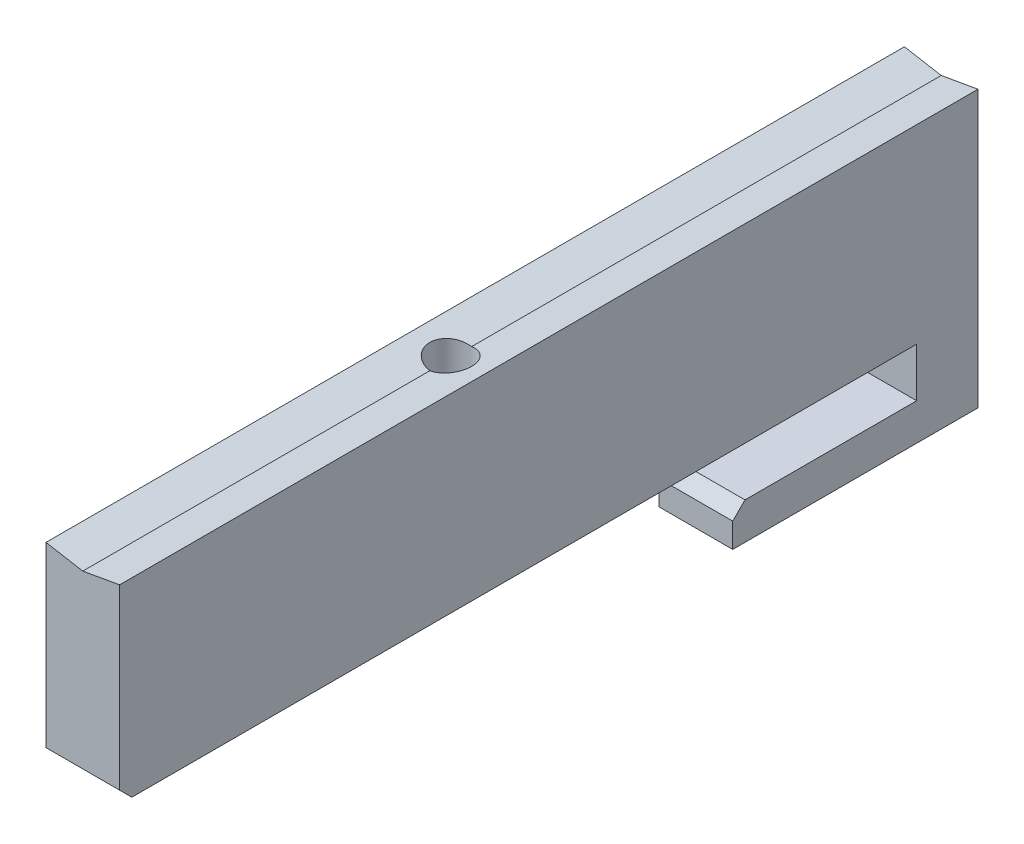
from build123d import *

# Parameters (mm, degrees)
ESQUISSE1_W             = 12
ESQUISSE1_H             = 45
BOSS_EXTRU_1_DEPTH      = 140
ESQUISSE2_W             = 100
ESQUISSE2_H             = 14
ENL_V_MAT_EXTRU_1_DEPTH = 143.303373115
ESQUISSE3_W             = 30
ESQUISSE3_H             = 8
ENL_V_MAT_EXTRU_2_DEPTH = 143.303373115
CHANFREIN1_SIZE         = 2
ESQUISSE4_R             = 2.6
ENL_V_MAT_EXTRU_3_DEPTH = 148.17676447
TROU_TARAUD_M8X1_251_D  = 6.8
ENL_V_MAT_EXTRU_4_DEPTH = 142.92339483


with BuildPart() as part:
    # Esquisse1 → Boss.-Extru.1 (new body)
    with BuildSketch(Plane.XY):
        Rectangle(ESQUISSE1_W, ESQUISSE1_H)
    extrude(amount=BOSS_EXTRU_1_DEPTH)

    # Esquisse2 → Enl_v. mat.-Extru.1 (cut, through all)
    with BuildSketch(Plane(origin=(6, 0, 0), x_dir=(0, 0, -1), z_dir=(1, 0, 0))):
        with Locations((-90, -15.5)):
            Rectangle(ESQUISSE2_W, ESQUISSE2_H)
    extrude(amount=-ENL_V_MAT_EXTRU_1_DEPTH, mode=Mode.SUBTRACT)

    # Esquisse3 → Enl_v. mat.-Extru.2 (cut, through all)
    with BuildSketch(Plane(origin=(6, 0, 0), x_dir=(0, 0, -1), z_dir=(1, 0, 0))):
        with Locations((-25, -12.5)):
            Rectangle(ESQUISSE3_W, ESQUISSE3_H)
    extrude(amount=-ENL_V_MAT_EXTRU_2_DEPTH, mode=Mode.SUBTRACT)

    # Chanfrein1
    chanfrein1_edges = [part.edges().sort_by_distance(p)[0] for p in [
        (0, -8.5, 140),
        (0, -16.5, 40),
    ]]
    chamfer(chanfrein1_edges, length=CHANFREIN1_SIZE)

    # Esquisse4 → Enl_v. mat.-Extru.3 (cut, through all)
    with BuildSketch(Plane(origin=(0, 22.5, 0), x_dir=(1, 0, 0), z_dir=(0, 1, 0))):
        with Locations(Location((0, -80, 0), (0, 0, 270))):
            Circle(ESQUISSE4_R)
    extrude(amount=-ENL_V_MAT_EXTRU_3_DEPTH, mode=Mode.SUBTRACT)

    # Trou taraud_ M8x1.251 (through all)
    with Locations(Plane(origin=(0, 22.5, 0), x_dir=(-1, 0, 0), z_dir=(0, 1, 0))):
        with Locations((0, 80)):
            Hole(TROU_TARAUD_M8X1_251_D / 2)

    # Esquisse11 → Enl_v. mat.-Extru.4 (cut, through all)
    with BuildSketch(Plane(origin=(0, 0, 0), x_dir=(-1, 0, 0), z_dir=(0, 0, -1))):
        Polygon((0, 21.442038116), (-6, 22.5), (6, 22.5), align=None)
    extrude(amount=-ENL_V_MAT_EXTRU_4_DEPTH, mode=Mode.SUBTRACT)


solid = part.part
